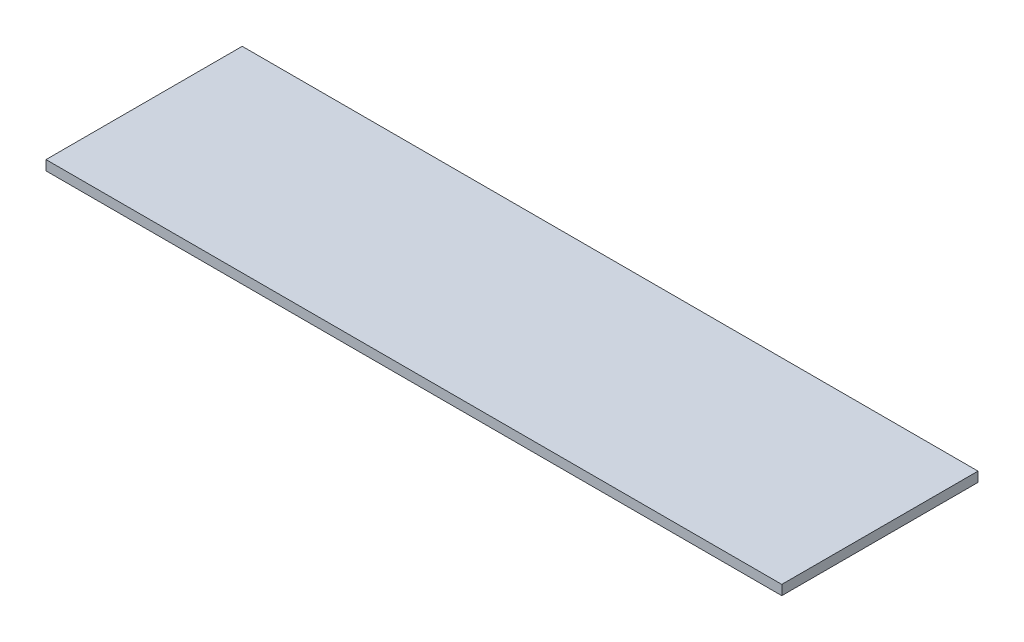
from build123d import *

# Parameters (mm, degrees)
ESQUISSE1_W      = 75
ESQUISSE1_H      = 20
EXTRUSION1_DEPTH = 1


with BuildPart() as part:
    # Esquisse1 → Extrusion1 (new body)
    with BuildSketch(Plane(origin=(0, 0, 0), x_dir=(1, 0, 0), z_dir=(0, 1, 0))):
        with Locations((37.5, 10)):
            Rectangle(ESQUISSE1_W, ESQUISSE1_H)
    extrude(amount=EXTRUSION1_DEPTH)


solid = part.part
